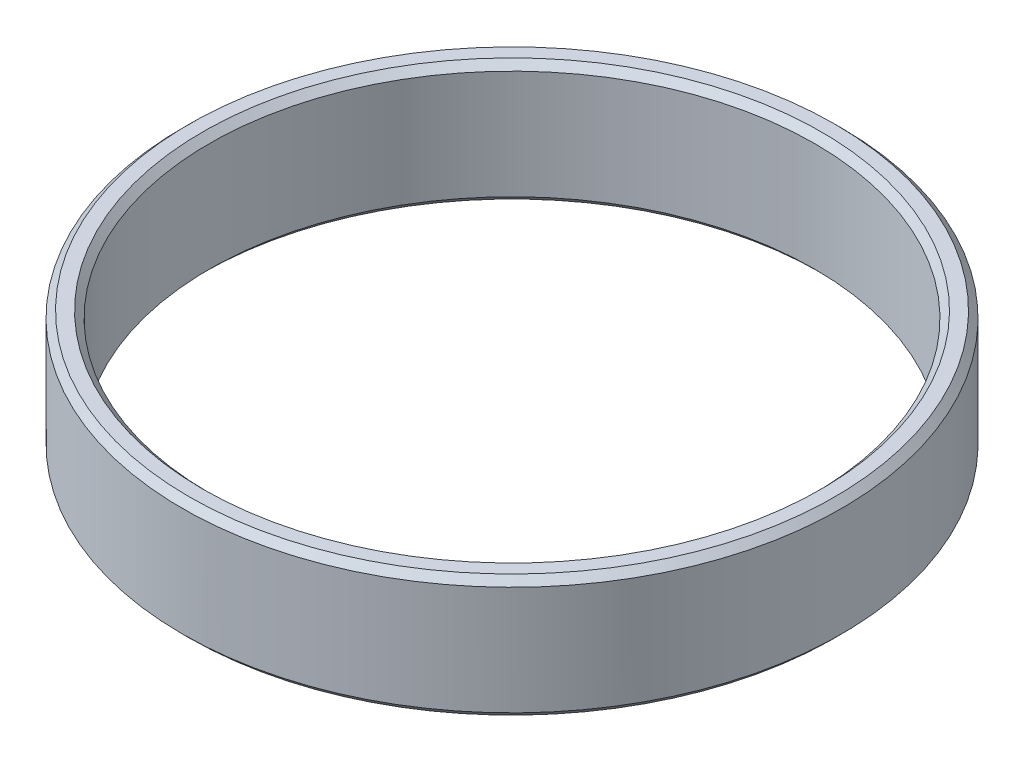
from build123d import *

# Parameters (mm, degrees)
SKETCH1_R           = 77.72908
SKETCH1_R_2         = 71.37908
BOSS_EXTRUDE1_DEPTH = 28.829
CHAMFER1_SIZE       = 1.5875


with BuildPart() as part:
    # Sketch1 → Boss-Extrude1 (new body)
    with BuildSketch(Plane(origin=(0, 0, 0), x_dir=(1, 0, 0), z_dir=(0, 1, 0))):
        with Locations(Location((0, 0, 0), (0, 0, 90))):
            Circle(SKETCH1_R)
        with Locations(Location((0, 0, 0), (0, 0, 90))):
            Circle(SKETCH1_R_2, mode=Mode.SUBTRACT)
    extrude(amount=BOSS_EXTRUDE1_DEPTH)

    # Chamfer1
    chamfer1_edges = [part.edges().sort_by_distance(p)[0] for p in [
        (0, 0, 77.72908),
        (0, 28.829, 77.72908),
        (0, 0, 71.37908),
        (0, 28.829, 71.37908),
    ]]
    chamfer(chamfer1_edges, length=CHAMFER1_SIZE)


solid = part.part
